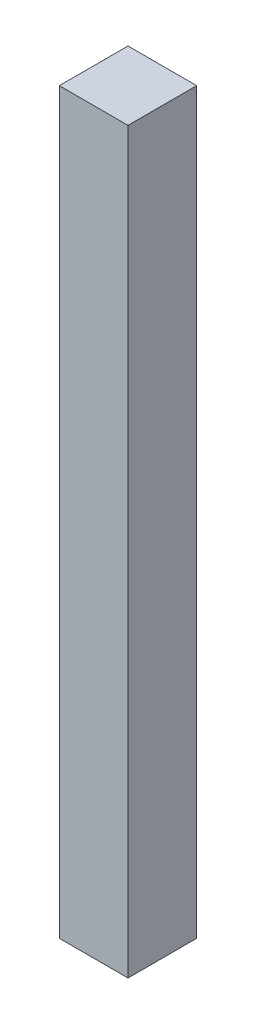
ISO-10303-21;
HEADER;
FILE_DESCRIPTION(('STEP AP214'),'2;1');
FILE_NAME('part.step','',(''),(''),'','','');
FILE_SCHEMA(('AUTOMOTIVE_DESIGN { 1 0 10303 214 1 1 1 1 }'));
ENDSEC;
DATA;
#1=APPLICATION_CONTEXT('core data for automotive mechanical design processes');
#2=APPLICATION_PROTOCOL_DEFINITION('international standard','automotive_design',2000,#1);
#3=PRODUCT_CONTEXT('',#1,'mechanical');
#4=PRODUCT('Part','Part','',(#3));
#5=PRODUCT_RELATED_PRODUCT_CATEGORY('part','',(#4));
#6=PRODUCT_DEFINITION_FORMATION('','',#4);
#7=PRODUCT_DEFINITION_CONTEXT('part definition',#1,'design');
#8=PRODUCT_DEFINITION('design','',#6,#7);
#9=PRODUCT_DEFINITION_SHAPE('','',#8);
#10=(LENGTH_UNIT() NAMED_UNIT(*) SI_UNIT(.MILLI.,.METRE.));
#11=(NAMED_UNIT(*) PLANE_ANGLE_UNIT() SI_UNIT($,.RADIAN.));
#12=(NAMED_UNIT(*) SI_UNIT($,.STERADIAN.) SOLID_ANGLE_UNIT());
#13=UNCERTAINTY_MEASURE_WITH_UNIT(LENGTH_MEASURE(1.E-05),#10,'distance_accuracy_value','');
#14=(GEOMETRIC_REPRESENTATION_CONTEXT(3) GLOBAL_UNCERTAINTY_ASSIGNED_CONTEXT((#13)) GLOBAL_UNIT_ASSIGNED_CONTEXT((#10,
#11,#12)) REPRESENTATION_CONTEXT('',''));
#15=CARTESIAN_POINT('',(0.,0.,0.));
#16=DIRECTION('',(0.,0.,1.));
#17=DIRECTION('',(1.,0.,0.));
#18=AXIS2_PLACEMENT_3D('',#15,#16,#17);
#19=CARTESIAN_POINT('',(33.5,720.,-33.5));
#20=DIRECTION('',(-1.,0.,0.));
#21=DIRECTION('',(0.,0.,1.));
#22=AXIS2_PLACEMENT_3D('',#19,#20,#21);
#23=PLANE('',#22);
#24=DIRECTION('',(0.,0.,-1.));
#25=VECTOR('',#24,1.);
#26=CARTESIAN_POINT('',(33.5,0.,-33.5));
#27=LINE('',#26,#25);
#28=CARTESIAN_POINT('',(33.5,0.,33.5));
#29=VERTEX_POINT('',#28);
#30=CARTESIAN_POINT('',(33.5,0.,-33.5));
#31=VERTEX_POINT('',#30);
#32=EDGE_CURVE('E95',#29,#31,#27,.T.);
#33=ORIENTED_EDGE('',*,*,#32,.T.);
#34=DIRECTION('',(0.,-1.,0.));
#35=VECTOR('',#34,1.);
#36=CARTESIAN_POINT('',(33.5,720.,-33.5));
#37=LINE('',#36,#35);
#38=CARTESIAN_POINT('',(33.5,720.,-33.5));
#39=VERTEX_POINT('',#38);
#40=EDGE_CURVE('E11',#39,#31,#37,.T.);
#41=ORIENTED_EDGE('',*,*,#40,.F.);
#42=DIRECTION('',(0.,0.,-1.));
#43=VECTOR('',#42,1.);
#44=CARTESIAN_POINT('',(33.5,720.,-33.5));
#45=LINE('',#44,#43);
#46=CARTESIAN_POINT('',(33.5,720.,33.5));
#47=VERTEX_POINT('',#46);
#48=EDGE_CURVE('E83',#47,#39,#45,.T.);
#49=ORIENTED_EDGE('',*,*,#48,.F.);
#50=DIRECTION('',(0.,-1.,0.));
#51=VECTOR('',#50,1.);
#52=CARTESIAN_POINT('',(33.5,720.,33.5));
#53=LINE('',#52,#51);
#54=EDGE_CURVE('E91',#47,#29,#53,.T.);
#55=ORIENTED_EDGE('',*,*,#54,.T.);
#56=EDGE_LOOP('',(#33,#41,#49,#55));
#57=FACE_BOUND('',#56,.T.);
#58=ADVANCED_FACE('F32',(#57),#23,.F.);
#59=CARTESIAN_POINT('',(-33.5,720.,-33.5));
#60=DIRECTION('',(0.,0.,1.));
#61=DIRECTION('',(1.,0.,0.));
#62=AXIS2_PLACEMENT_3D('',#59,#60,#61);
#63=PLANE('',#62);
#64=DIRECTION('',(-1.,0.,0.));
#65=VECTOR('',#64,1.);
#66=CARTESIAN_POINT('',(-33.5,0.,-33.5));
#67=LINE('',#66,#65);
#68=CARTESIAN_POINT('',(-33.5,0.,-33.5));
#69=VERTEX_POINT('',#68);
#70=EDGE_CURVE('E87',#31,#69,#67,.T.);
#71=ORIENTED_EDGE('',*,*,#70,.T.);
#72=DIRECTION('',(0.,-1.,0.));
#73=VECTOR('',#72,1.);
#74=CARTESIAN_POINT('',(-33.5,720.,-33.5));
#75=LINE('',#74,#73);
#76=CARTESIAN_POINT('',(-33.5,720.,-33.5));
#77=VERTEX_POINT('',#76);
#78=EDGE_CURVE('E40',#77,#69,#75,.T.);
#79=ORIENTED_EDGE('',*,*,#78,.F.);
#80=DIRECTION('',(-1.,0.,0.));
#81=VECTOR('',#80,1.);
#82=CARTESIAN_POINT('',(-33.5,720.,-33.5));
#83=LINE('',#82,#81);
#84=EDGE_CURVE('E78',#39,#77,#83,.T.);
#85=ORIENTED_EDGE('',*,*,#84,.F.);
#86=ORIENTED_EDGE('',*,*,#40,.T.);
#87=EDGE_LOOP('',(#71,#79,#85,#86));
#88=FACE_BOUND('',#87,.T.);
#89=ADVANCED_FACE('F86',(#88),#63,.F.);
#90=CARTESIAN_POINT('',(-33.5,720.,-33.5));
#91=DIRECTION('',(1.,0.,0.));
#92=DIRECTION('',(0.,0.,-1.));
#93=AXIS2_PLACEMENT_3D('',#90,#91,#92);
#94=PLANE('',#93);
#95=DIRECTION('',(0.,0.,1.));
#96=VECTOR('',#95,1.);
#97=CARTESIAN_POINT('',(-33.5,0.,-33.5));
#98=LINE('',#97,#96);
#99=CARTESIAN_POINT('',(-33.5,0.,33.5));
#100=VERTEX_POINT('',#99);
#101=EDGE_CURVE('E65',#69,#100,#98,.T.);
#102=ORIENTED_EDGE('',*,*,#101,.T.);
#103=DIRECTION('',(0.,-1.,0.));
#104=VECTOR('',#103,1.);
#105=CARTESIAN_POINT('',(-33.5,720.,33.5));
#106=LINE('',#105,#104);
#107=CARTESIAN_POINT('',(-33.5,720.,33.5));
#108=VERTEX_POINT('',#107);
#109=EDGE_CURVE('E88',#108,#100,#106,.T.);
#110=ORIENTED_EDGE('',*,*,#109,.F.);
#111=DIRECTION('',(0.,0.,1.));
#112=VECTOR('',#111,1.);
#113=CARTESIAN_POINT('',(-33.5,720.,-33.5));
#114=LINE('',#113,#112);
#115=EDGE_CURVE('E81',#77,#108,#114,.T.);
#116=ORIENTED_EDGE('',*,*,#115,.F.);
#117=ORIENTED_EDGE('',*,*,#78,.T.);
#118=EDGE_LOOP('',(#102,#110,#116,#117));
#119=FACE_BOUND('',#118,.T.);
#120=ADVANCED_FACE('F89',(#119),#94,.F.);
#121=CARTESIAN_POINT('',(-33.5,720.,33.5));
#122=DIRECTION('',(0.,0.,-1.));
#123=DIRECTION('',(-1.,0.,0.));
#124=AXIS2_PLACEMENT_3D('',#121,#122,#123);
#125=PLANE('',#124);
#126=DIRECTION('',(1.,0.,0.));
#127=VECTOR('',#126,1.);
#128=CARTESIAN_POINT('',(-33.5,0.,33.5));
#129=LINE('',#128,#127);
#130=EDGE_CURVE('E71',#100,#29,#129,.T.);
#131=ORIENTED_EDGE('',*,*,#130,.T.);
#132=ORIENTED_EDGE('',*,*,#54,.F.);
#133=DIRECTION('',(1.,0.,0.));
#134=VECTOR('',#133,1.);
#135=CARTESIAN_POINT('',(-33.5,720.,33.5));
#136=LINE('',#135,#134);
#137=EDGE_CURVE('E48',#108,#47,#136,.T.);
#138=ORIENTED_EDGE('',*,*,#137,.F.);
#139=ORIENTED_EDGE('',*,*,#109,.T.);
#140=EDGE_LOOP('',(#131,#132,#138,#139));
#141=FACE_BOUND('',#140,.T.);
#142=ADVANCED_FACE('F102',(#141),#125,.F.);
#143=CARTESIAN_POINT('',(0.,720.,0.));
#144=DIRECTION('',(0.,1.,0.));
#145=DIRECTION('',(0.,0.,1.));
#146=AXIS2_PLACEMENT_3D('',#143,#144,#145);
#147=PLANE('',#146);
#148=ORIENTED_EDGE('',*,*,#48,.T.);
#149=ORIENTED_EDGE('',*,*,#84,.T.);
#150=ORIENTED_EDGE('',*,*,#115,.T.);
#151=ORIENTED_EDGE('',*,*,#137,.T.);
#152=EDGE_LOOP('',(#148,#149,#150,#151));
#153=FACE_BOUND('',#152,.T.);
#154=ADVANCED_FACE('F79',(#153),#147,.T.);
#155=CARTESIAN_POINT('',(0.,0.,0.));
#156=DIRECTION('',(0.,1.,0.));
#157=DIRECTION('',(0.,0.,1.));
#158=AXIS2_PLACEMENT_3D('',#155,#156,#157);
#159=PLANE('',#158);
#160=ORIENTED_EDGE('',*,*,#32,.F.);
#161=ORIENTED_EDGE('',*,*,#130,.F.);
#162=ORIENTED_EDGE('',*,*,#101,.F.);
#163=ORIENTED_EDGE('',*,*,#70,.F.);
#164=EDGE_LOOP('',(#160,#161,#162,#163));
#165=FACE_BOUND('',#164,.T.);
#166=ADVANCED_FACE('F105',(#165),#159,.F.);
#167=CLOSED_SHELL('',(#58,#89,#120,#142,#154,#166));
#168=MANIFOLD_SOLID_BREP('B2',#167);
#169=ADVANCED_BREP_SHAPE_REPRESENTATION('',(#18,#168),#14);
#170=SHAPE_DEFINITION_REPRESENTATION(#9,#169);
ENDSEC;
END-ISO-10303-21;
